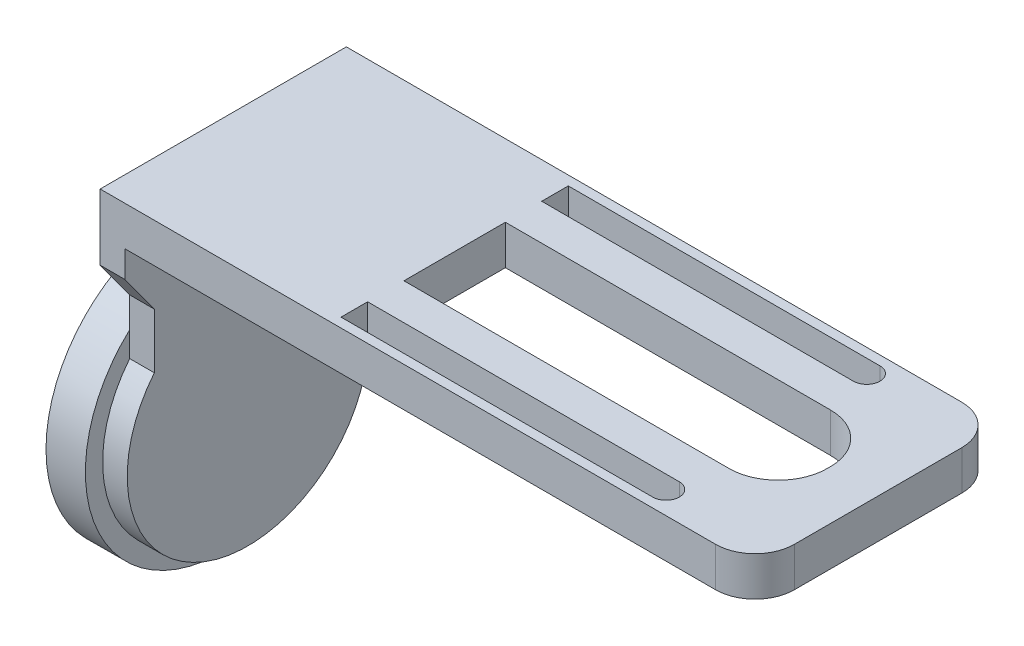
from build123d import *

# Parameters (mm, degrees)
BOSS_EXTRUDE1_DEPTH = 4
BOSS_EXTRUDE2_DEPTH = 2.5
SKETCH3_R           = 14
BOSS_EXTRUDE3_DEPTH = 4


with BuildPart() as part:
    # Sketch1 → Boss-Extrude1 (new body)
    with BuildSketch(Plane(origin=(0, 0, 0), x_dir=(1, 0, 0), z_dir=(0, 1, 0))):
        with BuildLine():
            Line((0, 0), (62.5, 0))
            ThreePointArc((62.5, 0), (65.328427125, -1.171572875), (66.5, -4))
            Line((66.5, -4), (66.5, -21))
            ThreePointArc((66.5, -21), (65.328427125, -23.828427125), (62.5, -25))
            Line((62.5, -25), (0, -25))
            Line((0, -25), (0, 0))
        make_face()
        with BuildLine():
            Line((23.5, -7.35), (56.51, -7.35))
            ThreePointArc((56.51, -7.35), (60.038462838, -8.811537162), (61.5, -12.34))
            Line((61.5, -12.34), (61.5, -12.66))
            ThreePointArc((61.5, -12.66), (60.038462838, -16.188462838), (56.51, -17.65))
            Line((56.51, -17.65), (23.5, -17.65))
            Line((23.5, -17.65), (23.5, -7.35))
        make_face(mode=Mode.SUBTRACT)
        with BuildLine():
            Line((23.5, -0.96), (55.151, -0.96))
            ThreePointArc((55.151, -0.96), (56.104887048, -1.355112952), (56.5, -2.309))
            Line((56.5, -2.309), (56.5, -2.311))
            ThreePointArc((56.5, -2.311), (56.104887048, -3.264887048), (55.151, -3.66))
            Line((55.151, -3.66), (23.5, -3.66))
            Line((23.5, -3.66), (23.5, -0.96))
        make_face(mode=Mode.SUBTRACT)
        with BuildLine():
            Line((23.5, -21.34), (55.151, -21.34))
            ThreePointArc((55.151, -21.34), (56.104887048, -21.735112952), (56.5, -22.689))
            Line((56.5, -22.689), (56.5, -22.691))
            ThreePointArc((56.5, -22.691), (56.104887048, -23.644887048), (55.151, -24.04))
            Line((55.151, -24.04), (23.5, -24.04))
            Line((23.5, -24.04), (23.5, -21.34))
        make_face(mode=Mode.SUBTRACT)
    extrude(amount=BOSS_EXTRUDE1_DEPTH)

    # Sketch2 → Boss-Extrude2 (add)
    with BuildSketch(Plane.ZY):
        with BuildLine():
            Line((3, -6.816145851), (3, -12.416145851))
            ThreePointArc((3, -12.416145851), (12.5, -32.4), (22, -12.416145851))
            Line((22, -12.416145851), (22, -6.816145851))
            Line((22, -6.816145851), (25, -2.7))
            Line((25, -2.7), (25, 0))
            Line((25, 0), (0, 0))
            Line((0, 0), (0, -2.7))
            Line((0, -2.7), (3, -6.816145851))
        make_face()
    extrude(amount=-BOSS_EXTRUDE2_DEPTH)

    # Sketch3 → Boss-Extrude3 (add)
    with BuildSketch(Plane.ZY):
        with Locations(Location((12.5, -20.15, 0), (0, 0, 132.732110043))):
            Circle(SKETCH3_R)
    extrude(amount=BOSS_EXTRUDE3_DEPTH)


solid = part.part
